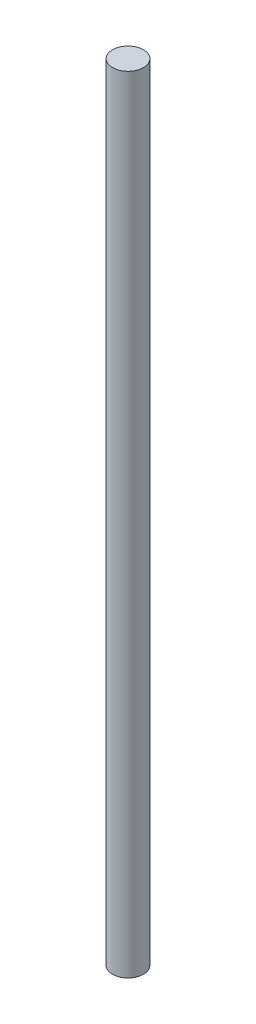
ISO-10303-21;
HEADER;
FILE_DESCRIPTION(('STEP AP214'),'2;1');
FILE_NAME('part.step','',(''),(''),'','','');
FILE_SCHEMA(('AUTOMOTIVE_DESIGN { 1 0 10303 214 1 1 1 1 }'));
ENDSEC;
DATA;
#1=APPLICATION_CONTEXT('core data for automotive mechanical design processes');
#2=APPLICATION_PROTOCOL_DEFINITION('international standard','automotive_design',2000,#1);
#3=PRODUCT_CONTEXT('',#1,'mechanical');
#4=PRODUCT('Part','Part','',(#3));
#5=PRODUCT_RELATED_PRODUCT_CATEGORY('part','',(#4));
#6=PRODUCT_DEFINITION_FORMATION('','',#4);
#7=PRODUCT_DEFINITION_CONTEXT('part definition',#1,'design');
#8=PRODUCT_DEFINITION('design','',#6,#7);
#9=PRODUCT_DEFINITION_SHAPE('','',#8);
#10=(LENGTH_UNIT() NAMED_UNIT(*) SI_UNIT(.MILLI.,.METRE.));
#11=(NAMED_UNIT(*) PLANE_ANGLE_UNIT() SI_UNIT($,.RADIAN.));
#12=(NAMED_UNIT(*) SI_UNIT($,.STERADIAN.) SOLID_ANGLE_UNIT());
#13=UNCERTAINTY_MEASURE_WITH_UNIT(LENGTH_MEASURE(1.E-05),#10,'distance_accuracy_value','');
#14=(GEOMETRIC_REPRESENTATION_CONTEXT(3) GLOBAL_UNCERTAINTY_ASSIGNED_CONTEXT((#13)) GLOBAL_UNIT_ASSIGNED_CONTEXT((#10,
#11,#12)) REPRESENTATION_CONTEXT('',''));
#15=CARTESIAN_POINT('',(0.,0.,0.));
#16=DIRECTION('',(0.,0.,1.));
#17=DIRECTION('',(1.,0.,0.));
#18=AXIS2_PLACEMENT_3D('',#15,#16,#17);
#19=CARTESIAN_POINT('',(0.,152.,0.));
#20=DIRECTION('',(0.,-1.,0.));
#21=DIRECTION('',(0.,0.,-1.));
#22=AXIS2_PLACEMENT_3D('',#19,#20,#21);
#23=CYLINDRICAL_SURFACE('',#22,3.);
#24=CARTESIAN_POINT('',(0.,152.,0.));
#25=DIRECTION('',(0.,1.,0.));
#26=DIRECTION('',(0.,0.,1.));
#27=AXIS2_PLACEMENT_3D('',#24,#25,#26);
#28=CIRCLE('',#27,3.);
#29=CARTESIAN_POINT('',(0.,152.,3.));
#30=VERTEX_POINT('',#29);
#31=EDGE_CURVE('E10',#30,#30,#28,.T.);
#32=ORIENTED_EDGE('',*,*,#31,.F.);
#33=EDGE_LOOP('',(#32));
#34=FACE_BOUND('',#33,.T.);
#35=CARTESIAN_POINT('',(0.,0.,0.));
#36=DIRECTION('',(0.,1.,0.));
#37=DIRECTION('',(0.,0.,1.));
#38=AXIS2_PLACEMENT_3D('',#35,#36,#37);
#39=CIRCLE('',#38,3.);
#40=CARTESIAN_POINT('',(0.,0.,3.));
#41=VERTEX_POINT('',#40);
#42=EDGE_CURVE('E36',#41,#41,#39,.T.);
#43=ORIENTED_EDGE('',*,*,#42,.T.);
#44=EDGE_LOOP('',(#43));
#45=FACE_BOUND('',#44,.T.);
#46=ADVANCED_FACE('F33',(#34,#45),#23,.T.);
#47=CARTESIAN_POINT('',(0.,152.,0.));
#48=DIRECTION('',(0.,1.,0.));
#49=DIRECTION('',(0.,0.,1.));
#50=AXIS2_PLACEMENT_3D('',#47,#48,#49);
#51=PLANE('',#50);
#52=ORIENTED_EDGE('',*,*,#31,.T.);
#53=EDGE_LOOP('',(#52));
#54=FACE_BOUND('',#53,.T.);
#55=ADVANCED_FACE('F48',(#54),#51,.T.);
#56=CARTESIAN_POINT('',(0.,0.,0.));
#57=DIRECTION('',(0.,1.,0.));
#58=DIRECTION('',(0.,0.,1.));
#59=AXIS2_PLACEMENT_3D('',#56,#57,#58);
#60=PLANE('',#59);
#61=ORIENTED_EDGE('',*,*,#42,.F.);
#62=EDGE_LOOP('',(#61));
#63=FACE_BOUND('',#62,.T.);
#64=ADVANCED_FACE('F46',(#63),#60,.F.);
#65=CLOSED_SHELL('',(#46,#55,#64));
#66=MANIFOLD_SOLID_BREP('B2',#65);
#67=ADVANCED_BREP_SHAPE_REPRESENTATION('',(#18,#66),#14);
#68=SHAPE_DEFINITION_REPRESENTATION(#9,#67);
ENDSEC;
END-ISO-10303-21;
